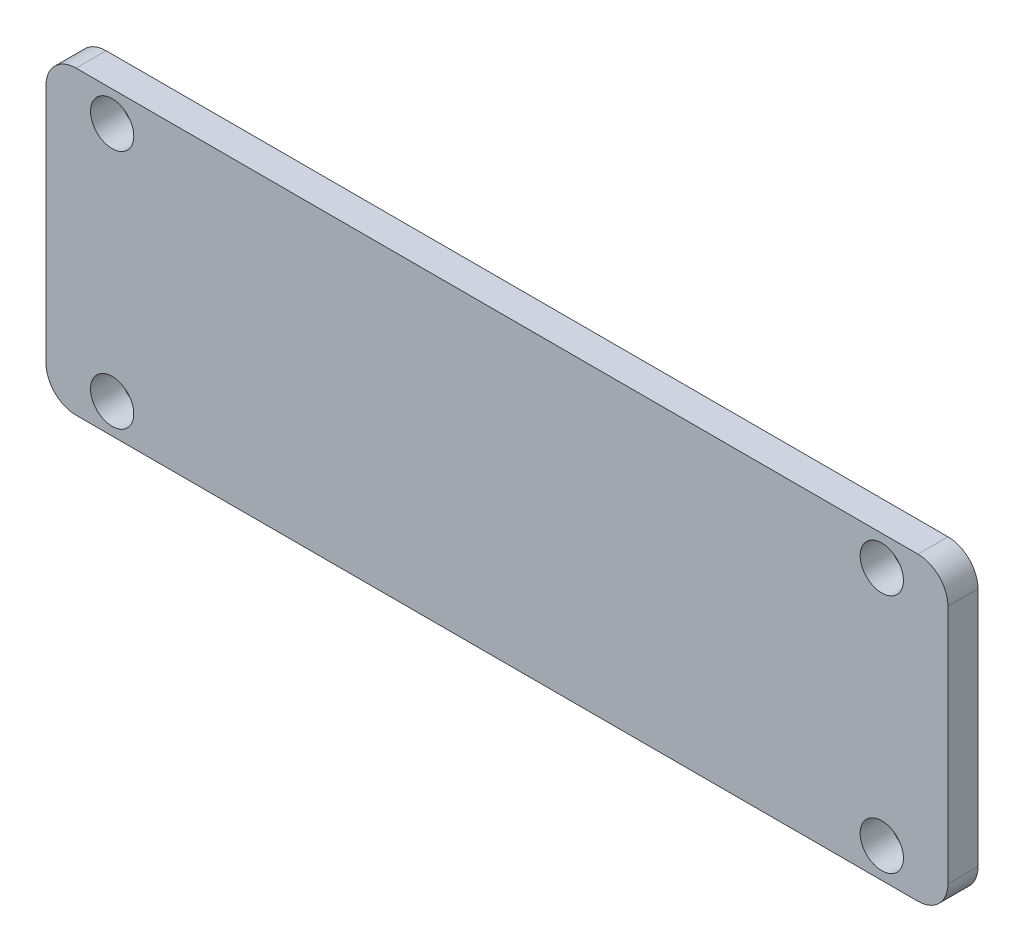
from build123d import *

# Parameters (mm, degrees)
SKETCH1_W          = 95.25
SKETCH1_H          = 31.75
SKETCH1_R          = 2.286
EXTRUDE1_DEPTH     = 3.175
CUT_EXTRUDE2_DEPTH = 0.635
FILLET1_R          = 3.175


with BuildPart() as part:
    # Sketch1 → Extrude1 (new body)
    with BuildSketch(Plane.XY):
        Rectangle(SKETCH1_W, SKETCH1_H)
        with Locations((-40.64, 12.7)):
            Circle(SKETCH1_R, mode=Mode.SUBTRACT)
        with Locations(Location((-40.64, -12.7, 0), (0, 0, 180))):
            Circle(SKETCH1_R, mode=Mode.SUBTRACT)
        with Locations((40.64, -12.7)):
            Circle(SKETCH1_R, mode=Mode.SUBTRACT)
        with Locations(Location((40.64, 12.7, 0), (0, 0, 180))):
            Circle(SKETCH1_R, mode=Mode.SUBTRACT)
    extrude(amount=EXTRUDE1_DEPTH)

    # Sketch2 → Cut-Extrude2 (cut)
    with BuildSketch(Plane.XY):
        with BuildLine():
            Line((-15.875, 6.35), (15.875, 6.35))
            ThreePointArc((15.875, 6.35), (18.12006403, 5.42006403), (19.05, 3.175))
            Line((19.05, 3.175), (19.05, -3.175))
            ThreePointArc((19.05, -3.175), (18.12006403, -5.42006403), (15.875, -6.35))
            Line((15.875, -6.35), (-15.875, -6.35))
            ThreePointArc((-15.875, -6.35), (-18.12006403, -5.42006403), (-19.05, -3.175))
            Line((-19.05, -3.175), (-19.05, 3.175))
            ThreePointArc((-19.05, 3.175), (-18.12006403, 5.42006403), (-15.875, 6.35))
        make_face()
    extrude(amount=CUT_EXTRUDE2_DEPTH, mode=Mode.SUBTRACT)

    # Fillet1
    fillet1_edges = [part.edges().sort_by_distance(p)[0] for p in [
        (-47.625, 15.875, 1.5875),
        (47.625, 15.875, 1.5875),
        (47.625, -15.875, 1.5875),
        (-47.625, -15.875, 1.5875),
    ]]
    fillet(fillet1_edges, radius=FILLET1_R)


solid = part.part
